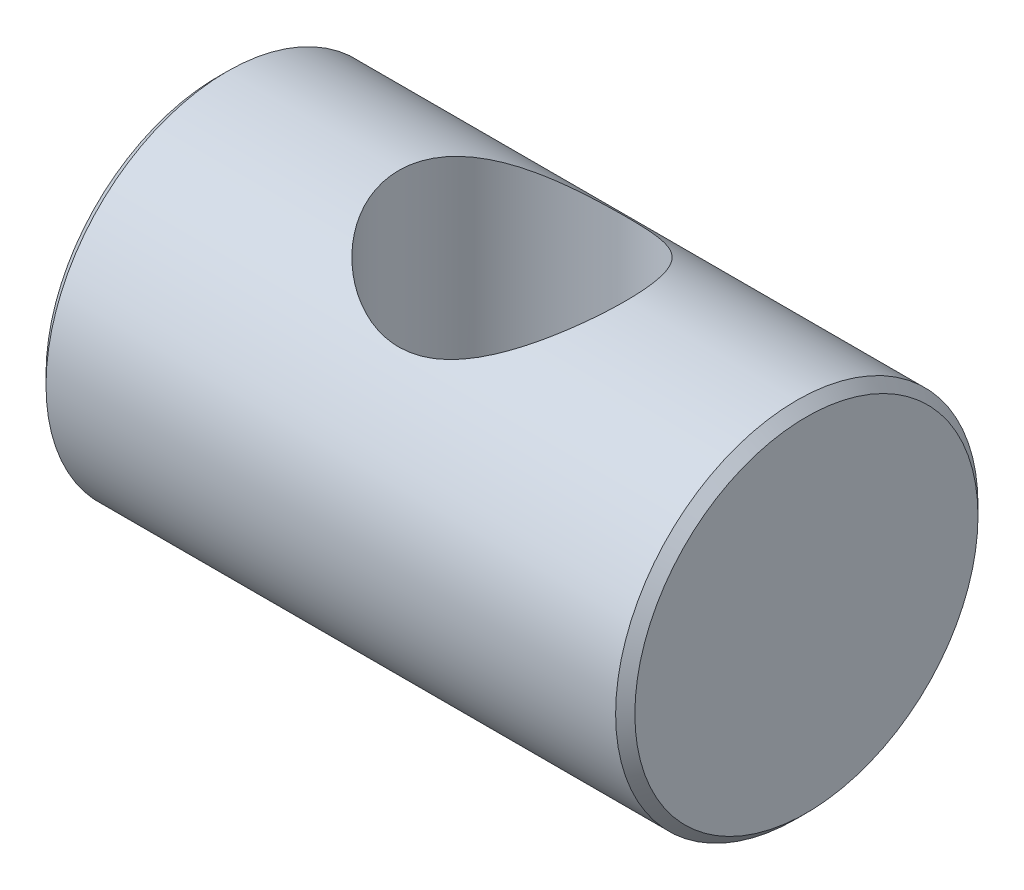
ISO-10303-21;
HEADER;
FILE_DESCRIPTION(('STEP AP214'),'2;1');
FILE_NAME('part.step','',(''),(''),'','','');
FILE_SCHEMA(('AUTOMOTIVE_DESIGN { 1 0 10303 214 1 1 1 1 }'));
ENDSEC;
DATA;
#1=APPLICATION_CONTEXT('core data for automotive mechanical design processes');
#2=APPLICATION_PROTOCOL_DEFINITION('international standard','automotive_design',2000,#1);
#3=PRODUCT_CONTEXT('',#1,'mechanical');
#4=PRODUCT('Part','Part','',(#3));
#5=PRODUCT_RELATED_PRODUCT_CATEGORY('part','',(#4));
#6=PRODUCT_DEFINITION_FORMATION('','',#4);
#7=PRODUCT_DEFINITION_CONTEXT('part definition',#1,'design');
#8=PRODUCT_DEFINITION('design','',#6,#7);
#9=PRODUCT_DEFINITION_SHAPE('','',#8);
#10=(LENGTH_UNIT() NAMED_UNIT(*) SI_UNIT(.MILLI.,.METRE.));
#11=(NAMED_UNIT(*) PLANE_ANGLE_UNIT() SI_UNIT($,.RADIAN.));
#12=(NAMED_UNIT(*) SI_UNIT($,.STERADIAN.) SOLID_ANGLE_UNIT());
#13=UNCERTAINTY_MEASURE_WITH_UNIT(LENGTH_MEASURE(1.E-05),#10,'distance_accuracy_value','');
#14=(GEOMETRIC_REPRESENTATION_CONTEXT(3) GLOBAL_UNCERTAINTY_ASSIGNED_CONTEXT((#13)) GLOBAL_UNIT_ASSIGNED_CONTEXT((#10,
#11,#12)) REPRESENTATION_CONTEXT('',''));
#15=CARTESIAN_POINT('',(0.,0.,0.));
#16=DIRECTION('',(0.,0.,1.));
#17=DIRECTION('',(1.,0.,0.));
#18=AXIS2_PLACEMENT_3D('',#15,#16,#17);
#19=CARTESIAN_POINT('',(6.5,3.78786796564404,0.));
#20=DIRECTION('',(-1.,0.,0.));
#21=DIRECTION('',(0.,0.,1.));
#22=AXIS2_PLACEMENT_3D('',#19,#20,#21);
#23=PLANE('',#22);
#24=CARTESIAN_POINT('',(6.49999999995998,0.,0.));
#25=DIRECTION('',(-1.,0.,0.));
#26=DIRECTION('',(0.,0.,1.));
#27=AXIS2_PLACEMENT_3D('',#24,#25,#26);
#28=CIRCLE('',#27,3.7878679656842);
#29=CARTESIAN_POINT('',(6.49999999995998,0.,3.7878679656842));
#30=VERTEX_POINT('',#29);
#31=EDGE_CURVE('E43',#30,#30,#28,.T.);
#32=ORIENTED_EDGE('',*,*,#31,.F.);
#33=EDGE_LOOP('',(#32));
#34=FACE_BOUND('',#33,.T.);
#35=ADVANCED_FACE('F12',(#34),#23,.F.);
#36=CARTESIAN_POINT('',(-6.5,0.,0.));
#37=DIRECTION('',(1.,0.,0.));
#38=DIRECTION('',(0.,0.,-1.));
#39=AXIS2_PLACEMENT_3D('',#36,#37,#38);
#40=PLANE('',#39);
#41=CARTESIAN_POINT('',(-6.50000000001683,0.,0.));
#42=DIRECTION('',(1.,0.,0.));
#43=DIRECTION('',(0.,0.,-1.));
#44=AXIS2_PLACEMENT_3D('',#41,#42,#43);
#45=CIRCLE('',#44,3.78786796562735);
#46=CARTESIAN_POINT('',(-6.50000000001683,0.,-3.78786796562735));
#47=VERTEX_POINT('',#46);
#48=EDGE_CURVE('E70',#47,#47,#45,.T.);
#49=ORIENTED_EDGE('',*,*,#48,.F.);
#50=EDGE_LOOP('',(#49));
#51=FACE_BOUND('',#50,.T.);
#52=ADVANCED_FACE('F59',(#51),#40,.F.);
#53=CARTESIAN_POINT('',(6.28786796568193,0.,0.));
#54=DIRECTION('',(-1.,0.,0.));
#55=DIRECTION('',(0.,0.,1.));
#56=AXIS2_PLACEMENT_3D('',#53,#54,#55);
#57=CONICAL_SURFACE('',#56,4.0000000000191,0.785398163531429);
#58=CARTESIAN_POINT('',(6.28786796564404,0.,0.));
#59=DIRECTION('',(1.,0.,0.));
#60=DIRECTION('',(0.,0.,-1.));
#61=AXIS2_PLACEMENT_3D('',#58,#59,#60);
#62=CIRCLE('',#61,4.);
#63=CARTESIAN_POINT('',(6.28786796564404,0.,-4.));
#64=VERTEX_POINT('',#63);
#65=EDGE_CURVE('E37',#64,#64,#62,.F.);
#66=ORIENTED_EDGE('',*,*,#65,.F.);
#67=EDGE_LOOP('',(#66));
#68=FACE_BOUND('',#67,.T.);
#69=ORIENTED_EDGE('',*,*,#31,.T.);
#70=EDGE_LOOP('',(#69));
#71=FACE_BOUND('',#70,.T.);
#72=ADVANCED_FACE('F64',(#68,#71),#57,.T.);
#73=CARTESIAN_POINT('',(-6.28786796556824,0.,0.));
#74=DIRECTION('',(1.,0.,0.));
#75=DIRECTION('',(0.,0.,-1.));
#76=AXIS2_PLACEMENT_3D('',#73,#74,#75);
#77=CONICAL_SURFACE('',#76,4.00000000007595,0.785398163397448);
#78=ORIENTED_EDGE('',*,*,#48,.T.);
#79=EDGE_LOOP('',(#78));
#80=FACE_BOUND('',#79,.T.);
#81=CARTESIAN_POINT('',(-6.28786796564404,0.,0.));
#82=DIRECTION('',(1.,0.,0.));
#83=DIRECTION('',(0.,0.,-1.));
#84=AXIS2_PLACEMENT_3D('',#81,#82,#83);
#85=CIRCLE('',#84,4.);
#86=CARTESIAN_POINT('',(-6.28786796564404,0.,-4.));
#87=VERTEX_POINT('',#86);
#88=EDGE_CURVE('E31',#87,#87,#85,.T.);
#89=ORIENTED_EDGE('',*,*,#88,.F.);
#90=EDGE_LOOP('',(#89));
#91=FACE_BOUND('',#90,.T.);
#92=ADVANCED_FACE('F56',(#80,#91),#77,.T.);
#93=CARTESIAN_POINT('',(6.5,0.,0.));
#94=DIRECTION('',(1.,0.,0.));
#95=DIRECTION('',(0.,0.,-1.));
#96=AXIS2_PLACEMENT_3D('',#93,#94,#95);
#97=CYLINDRICAL_SURFACE('',#96,4.);
#98=CARTESIAN_POINT('',(2.5,-4.,0.));
#99=CARTESIAN_POINT('',(2.49998952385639,-3.99999041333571,0.127017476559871));
#100=CARTESIAN_POINT('',(2.49025350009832,-3.9938860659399,0.254191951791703));
#101=CARTESIAN_POINT('',(2.45182887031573,-3.97004375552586,0.504637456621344));
#102=CARTESIAN_POINT('',(2.4231041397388,-3.95228361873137,0.627900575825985));
#103=CARTESIAN_POINT('',(2.34837714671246,-3.90691695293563,0.866410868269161));
#104=CARTESIAN_POINT('',(2.30246039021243,-3.87935918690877,0.981694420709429));
#105=CARTESIAN_POINT('',(2.19522833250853,-3.81669199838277,1.20252080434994));
#106=CARTESIAN_POINT('',(2.13391473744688,-3.7815834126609,1.30806471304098));
#107=CARTESIAN_POINT('',(1.9922268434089,-3.70340304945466,1.51594836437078));
#108=CARTESIAN_POINT('',(1.91072139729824,-3.65991924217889,1.61735911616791));
#109=CARTESIAN_POINT('',(1.73356165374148,-3.57062700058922,1.80597275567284));
#110=CARTESIAN_POINT('',(1.63788834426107,-3.52481549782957,1.89315621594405));
#111=CARTESIAN_POINT('',(1.4199322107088,-3.42860837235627,2.06285746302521));
#112=CARTESIAN_POINT('',(1.29580042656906,-3.37843221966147,2.14314412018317));
#113=CARTESIAN_POINT('',(1.03287036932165,-3.28660396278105,2.28147932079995));
#114=CARTESIAN_POINT('',(0.894097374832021,-3.24493752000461,2.33956541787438));
#115=CARTESIAN_POINT('',(0.642378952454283,-3.18619151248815,2.41866801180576));
#116=CARTESIAN_POINT('',(0.532066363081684,-3.16553811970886,2.44539104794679));
#117=CARTESIAN_POINT('',(0.307388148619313,-3.1356271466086,2.4836368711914));
#118=CARTESIAN_POINT('',(0.193028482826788,-3.12635347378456,2.49518112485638));
#119=CARTESIAN_POINT('',(-0.0368260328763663,-3.12059771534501,2.50237836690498));
#120=CARTESIAN_POINT('',(-0.152323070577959,-3.12414917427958,2.49798968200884));
#121=CARTESIAN_POINT('',(-0.380620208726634,-3.14354804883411,2.47352633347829));
#122=CARTESIAN_POINT('',(-0.493418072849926,-3.15940531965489,2.45343909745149));
#123=CARTESIAN_POINT('',(-0.710876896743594,-3.20065145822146,2.3993620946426));
#124=CARTESIAN_POINT('',(-0.815664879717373,-3.22581428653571,2.36570043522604));
#125=CARTESIAN_POINT('',(-1.01832239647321,-3.28291134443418,2.28580369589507));
#126=CARTESIAN_POINT('',(-1.11618946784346,-3.31484796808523,2.2395641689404));
#127=CARTESIAN_POINT('',(-1.32166640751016,-3.38909625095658,2.12589830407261));
#128=CARTESIAN_POINT('',(-1.42768105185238,-3.4322315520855,2.05612773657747));
#129=CARTESIAN_POINT('',(-1.6276611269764,-3.52011451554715,1.90176111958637));
#130=CARTESIAN_POINT('',(-1.72161400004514,-3.56486379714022,1.81714983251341));
#131=CARTESIAN_POINT('',(-1.91060100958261,-3.65959667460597,1.61904732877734));
#132=CARTESIAN_POINT('',(-2.0032559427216,-3.70922571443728,1.50309447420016));
#133=CARTESIAN_POINT('',(-2.16771179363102,-3.8005660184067,1.25426444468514));
#134=CARTESIAN_POINT('',(-2.23952090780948,-3.84228039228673,1.12139395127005));
#135=CARTESIAN_POINT('',(-2.32734595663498,-3.89435975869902,0.915775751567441));
#136=CARTESIAN_POINT('',(-2.35283428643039,-3.90966874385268,0.848193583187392));
#137=CARTESIAN_POINT('',(-2.39800765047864,-3.93701839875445,0.710492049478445));
#138=CARTESIAN_POINT('',(-2.41769603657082,-3.94906095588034,0.640374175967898));
#139=CARTESIAN_POINT('',(-2.45093416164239,-3.96949699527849,0.498239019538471));
#140=CARTESIAN_POINT('',(-2.464489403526,-3.97789374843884,0.426223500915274));
#141=CARTESIAN_POINT('',(-2.48524629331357,-3.99078766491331,0.280965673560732));
#142=CARTESIAN_POINT('',(-2.49244902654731,-3.99528549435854,0.207723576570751));
#143=CARTESIAN_POINT('',(-2.50310930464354,-4.00193773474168,0.00911917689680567));
#144=CARTESIAN_POINT('',(-2.50040036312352,-4.000238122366,-0.116782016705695));
#145=CARTESIAN_POINT('',(-2.47624033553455,-3.98518313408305,-0.365967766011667));
#146=CARTESIAN_POINT('',(-2.45479052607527,-3.97182855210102,-0.489252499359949));
#147=CARTESIAN_POINT('',(-2.39552141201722,-3.93547975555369,-0.725036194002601));
#148=CARTESIAN_POINT('',(-2.35837527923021,-3.91288306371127,-0.837768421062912));
#149=CARTESIAN_POINT('',(-2.26940762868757,-3.85991402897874,-1.05527816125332));
#150=CARTESIAN_POINT('',(-2.21758365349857,-3.82954038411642,-1.16005433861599));
#151=CARTESIAN_POINT('',(-2.09496946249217,-3.75980014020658,-1.37016761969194));
#152=CARTESIAN_POINT('',(-2.02279282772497,-3.71983526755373,-1.47449380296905));
#153=CARTESIAN_POINT('',(-1.86441230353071,-3.63613942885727,-1.67028541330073));
#154=CARTESIAN_POINT('',(-1.77819283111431,-3.59240430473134,-1.76173634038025));
#155=CARTESIAN_POINT('',(-1.57972991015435,-3.49811738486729,-1.94294835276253));
#156=CARTESIAN_POINT('',(-1.46552558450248,-3.44749766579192,-2.03053702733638));
#157=CARTESIAN_POINT('',(-1.22224843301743,-3.35133525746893,-2.18560704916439));
#158=CARTESIAN_POINT('',(-1.09318598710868,-3.30578906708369,-2.25310231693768));
#159=CARTESIAN_POINT('',(-0.850615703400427,-3.23467060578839,-2.35369543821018));
#160=CARTESIAN_POINT('',(-0.739518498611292,-3.20691272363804,-2.39103791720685));
#161=CARTESIAN_POINT('',(-0.511213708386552,-3.16210061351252,-2.45000216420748));
#162=CARTESIAN_POINT('',(-0.394015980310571,-3.1450296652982,-2.47164849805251));
#163=CARTESIAN_POINT('',(-0.155819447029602,-3.124126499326,-2.49802767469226));
#164=CARTESIAN_POINT('',(-0.0348028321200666,-3.12037003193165,-2.50266374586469));
#165=CARTESIAN_POINT('',(0.206261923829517,-3.12698126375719,-2.49439556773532));
#166=CARTESIAN_POINT('',(0.326309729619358,-3.13735365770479,-2.48148548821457));
#167=CARTESIAN_POINT('',(0.552059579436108,-3.16910777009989,-2.44076547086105));
#168=CARTESIAN_POINT('',(0.658138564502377,-3.18953614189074,-2.41423847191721));
#169=CARTESIAN_POINT('',(0.864270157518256,-3.23835062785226,-2.34835238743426));
#170=CARTESIAN_POINT('',(0.964320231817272,-3.26674005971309,-2.30898795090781));
#171=CARTESIAN_POINT('',(1.17119332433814,-3.33327797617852,-2.21205415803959));
#172=CARTESIAN_POINT('',(1.27689994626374,-3.3722442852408,-2.15267427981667));
#173=CARTESIAN_POINT('',(1.47787738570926,-3.45335445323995,-2.01999894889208));
#174=CARTESIAN_POINT('',(1.57313966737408,-3.49550086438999,-1.94669224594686));
#175=CARTESIAN_POINT('',(1.77002558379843,-3.58803675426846,-1.77134669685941));
#176=CARTESIAN_POINT('',(1.86916976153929,-3.63840488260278,-1.66649284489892));
#177=CARTESIAN_POINT('',(2.04900159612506,-3.7339805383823,-1.43961937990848));
#178=CARTESIAN_POINT('',(2.12967782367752,-3.77918486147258,-1.3175892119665));
#179=CARTESIAN_POINT('',(2.23456343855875,-3.83959214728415,-1.12346357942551));
#180=CARTESIAN_POINT('',(2.26687480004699,-3.85851834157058,-1.05679601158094));
#181=CARTESIAN_POINT('',(2.32567225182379,-3.89335165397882,-0.920199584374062));
#182=CARTESIAN_POINT('',(2.3521617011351,-3.9092605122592,-0.850272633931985));
#183=CARTESIAN_POINT('',(2.39885714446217,-3.93753374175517,-0.707873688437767));
#184=CARTESIAN_POINT('',(2.41908005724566,-3.94990764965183,-0.635409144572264));
#185=CARTESIAN_POINT('',(2.45297545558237,-3.97075677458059,-0.488456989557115));
#186=CARTESIAN_POINT('',(2.46665277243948,-3.97923486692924,-0.413970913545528));
#187=CARTESIAN_POINT('',(2.48459041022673,-3.99038271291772,-0.28285260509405));
#188=CARTESIAN_POINT('',(2.49036153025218,-3.99398159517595,-0.226501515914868));
#189=CARTESIAN_POINT('',(2.49806878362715,-3.99879245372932,-0.113444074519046));
#190=CARTESIAN_POINT('',(2.50000467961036,-4.00000428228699,-0.0567377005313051));
#191=CARTESIAN_POINT('',(2.5,-4.,0.));
#192=B_SPLINE_CURVE_WITH_KNOTS('',3,(#98,#99,#100,#101,#102,#103,#104,#105,#106,#107,#108,#109,
#110,#111,#112,#113,#114,#115,#116,#117,#118,#119,#120,#121,#122,#123,#124,#125,#126,#127,#128,
#129,#130,#131,#132,#133,#134,#135,#136,#137,#138,#139,#140,#141,#142,#143,#144,#145,#146,#147,
#148,#149,#150,#151,#152,#153,#154,#155,#156,#157,#158,#159,#160,#161,#162,#163,#164,#165,#166,
#167,#168,#169,#170,#171,#172,#173,#174,#175,#176,#177,#178,#179,#180,#181,#182,#183,#184,#185,
#186,#187,#188,#189,#190,#191),.UNSPECIFIED.,.T.,.F.,(4,2,2,2,2,2,2,2,2,2,2,2,2,2,2,2,2,2,2,2,2,
2,2,2,2,2,2,2,2,2,2,2,2,2,2,2,2,2,2,2,2,2,2,2,2,2,4),(0.,0.380824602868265,0.762375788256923,
1.14205397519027,1.52169010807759,1.93164374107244,2.34215256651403,2.80825951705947,
3.27357449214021,3.61824017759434,3.96241789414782,4.30749646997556,4.65285169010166,
4.99031678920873,5.32790135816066,5.7285490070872,6.12961045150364,6.59684361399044,
7.06389281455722,7.28510978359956,7.50619865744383,7.72708876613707,7.94794112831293,
8.32363778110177,8.69930884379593,9.06028425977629,9.42132014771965,9.81879878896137,
10.216721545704,10.6724083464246,11.1277787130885,11.4876929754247,11.8470427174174,
12.2084336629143,12.5699447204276,12.9023575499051,13.2349091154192,13.6156046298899,
13.9966089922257,14.4531049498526,14.9098826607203,15.1389848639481,15.3679545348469,
15.5963005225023,15.8244777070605,15.994578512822,16.1646898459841),.UNSPECIFIED.);
#193=CARTESIAN_POINT('',(2.5,-4.,0.));
#194=VERTEX_POINT('',#193);
#195=EDGE_CURVE('E8',#194,#194,#192,.T.);
#196=ORIENTED_EDGE('',*,*,#195,.F.);
#197=EDGE_LOOP('',(#196));
#198=FACE_BOUND('',#197,.T.);
#199=CARTESIAN_POINT('',(0.,3.1224989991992,2.5));
#200=CARTESIAN_POINT('',(0.0621567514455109,3.12249991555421,2.49999941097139));
#201=CARTESIAN_POINT('',(0.124325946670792,3.12436490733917,2.49767581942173));
#202=CARTESIAN_POINT('',(0.248117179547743,3.13172923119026,2.48843349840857));
#203=CARTESIAN_POINT('',(0.309738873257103,3.13723070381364,2.48151206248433));
#204=CARTESIAN_POINT('',(0.493226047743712,3.15888953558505,2.45397595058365));
#205=CARTESIAN_POINT('',(0.613548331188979,3.18020036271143,2.42658990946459));
#206=CARTESIAN_POINT('',(0.845598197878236,3.23299770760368,2.35576217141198));
#207=CARTESIAN_POINT('',(0.957390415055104,3.26439575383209,2.31245961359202));
#208=CARTESIAN_POINT('',(1.17200852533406,3.33366000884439,2.21143916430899));
#209=CARTESIAN_POINT('',(1.27483417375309,3.37152639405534,2.15372087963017));
#210=CARTESIAN_POINT('',(1.48373398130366,3.45559225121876,2.01647682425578));
#211=CARTESIAN_POINT('',(1.58839332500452,3.50222814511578,1.93506425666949));
#212=CARTESIAN_POINT('',(1.78376155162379,3.59505503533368,1.75662526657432));
#213=CARTESIAN_POINT('',(1.87445827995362,3.64124561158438,1.65958538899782));
#214=CARTESIAN_POINT('',(2.05022029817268,3.73459524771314,1.43833990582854));
#215=CARTESIAN_POINT('',(2.13328618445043,3.78119887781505,1.31226934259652));
#216=CARTESIAN_POINT('',(2.24054515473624,3.84307251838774,1.11163395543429));
#217=CARTESIAN_POINT('',(2.27341513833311,3.86236283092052,1.04281240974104));
#218=CARTESIAN_POINT('',(2.33295468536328,3.89770436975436,0.90175876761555));
#219=CARTESIAN_POINT('',(2.35962853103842,3.91375783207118,0.829529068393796));
#220=CARTESIAN_POINT('',(2.40398381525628,3.94066759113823,0.689700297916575));
#221=CARTESIAN_POINT('',(2.42230197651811,3.95188535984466,0.622371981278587));
#222=CARTESIAN_POINT('',(2.45330228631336,3.97096241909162,0.485997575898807));
#223=CARTESIAN_POINT('',(2.46598768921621,3.97882364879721,0.416952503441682));
#224=CARTESIAN_POINT('',(2.48551379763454,3.99095470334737,0.277765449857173));
#225=CARTESIAN_POINT('',(2.49235811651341,3.99522674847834,0.207624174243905));
#226=CARTESIAN_POINT('',(2.50009921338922,4.00006125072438,0.0669114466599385));
#227=CARTESIAN_POINT('',(2.50099667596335,4.00062413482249,-0.00365995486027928));
#228=CARTESIAN_POINT('',(2.49527462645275,3.99704479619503,-0.196045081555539));
#229=CARTESIAN_POINT('',(2.48269349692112,3.98917040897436,-0.317681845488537));
#230=CARTESIAN_POINT('',(2.44026978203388,3.96290903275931,-0.556636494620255));
#231=CARTESIAN_POINT('',(2.41042589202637,3.94452124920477,-0.673954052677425));
#232=CARTESIAN_POINT('',(2.33479144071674,3.89876170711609,-0.901771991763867));
#233=CARTESIAN_POINT('',(2.28896008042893,3.87136697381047,-1.01225407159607));
#234=CARTESIAN_POINT('',(2.18306276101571,3.80971291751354,-1.22404012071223));
#235=CARTESIAN_POINT('',(2.12299355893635,3.77545203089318,-1.32534199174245));
#236=CARTESIAN_POINT('',(1.98194358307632,3.69786441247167,-1.52942649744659));
#237=CARTESIAN_POINT('',(1.89929072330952,3.65394006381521,-1.63082454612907));
#238=CARTESIAN_POINT('',(1.71973526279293,3.56390927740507,-1.81919733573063));
#239=CARTESIAN_POINT('',(1.62281195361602,3.51779973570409,-1.90615071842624));
#240=CARTESIAN_POINT('',(1.40258874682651,3.42142883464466,-2.07470887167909));
#241=CARTESIAN_POINT('',(1.27749723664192,3.37141162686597,-2.15413229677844));
#242=CARTESIAN_POINT('',(1.01270776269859,3.28028278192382,-2.29052307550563));
#243=CARTESIAN_POINT('',(0.873037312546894,3.23915480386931,-2.34753179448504));
#244=CARTESIAN_POINT('',(0.620461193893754,3.18183753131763,-2.42437133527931));
#245=CARTESIAN_POINT('',(0.510178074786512,3.16193408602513,-2.45003683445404));
#246=CARTESIAN_POINT('',(0.285769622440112,3.13358277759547,-2.48620337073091));
#247=CARTESIAN_POINT('',(0.171649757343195,3.12511926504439,-2.49672512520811));
#248=CARTESIAN_POINT('',(-0.0574573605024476,3.12092267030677,-2.5019707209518));
#249=CARTESIAN_POINT('',(-0.172446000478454,3.12521876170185,-2.49665835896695));
#250=CARTESIAN_POINT('',(-0.399561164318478,3.14592085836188,-2.47051466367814));
#251=CARTESIAN_POINT('',(-0.511685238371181,3.16233689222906,-2.44967047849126));
#252=CARTESIAN_POINT('',(-0.728436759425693,3.20460120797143,-2.39409874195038));
#253=CARTESIAN_POINT('',(-0.833157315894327,3.23028954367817,-2.35960571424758));
#254=CARTESIAN_POINT('',(-1.03557469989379,3.28831148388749,-2.27804893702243));
#255=CARTESIAN_POINT('',(-1.13326901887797,3.32064744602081,-2.23098072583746));
#256=CARTESIAN_POINT('',(-1.33861194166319,3.39574401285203,-2.11530798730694));
#257=CARTESIAN_POINT('',(-1.44461452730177,3.43931724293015,-2.04430931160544));
#258=CARTESIAN_POINT('',(-1.64437066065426,3.52787943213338,-1.88737868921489));
#259=CARTESIAN_POINT('',(-1.73811132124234,3.57286982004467,-1.80143124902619));
#260=CARTESIAN_POINT('',(-1.92596407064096,3.66766209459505,-1.60076932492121));
#261=CARTESIAN_POINT('',(-2.0177273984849,3.71707933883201,-1.48365201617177));
#262=CARTESIAN_POINT('',(-2.18014701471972,3.80768973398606,-1.23256787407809));
#263=CARTESIAN_POINT('',(-2.25081319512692,3.84888673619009,-1.09860897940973));
#264=CARTESIAN_POINT('',(-2.33658106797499,3.89988966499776,-0.891930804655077));
#265=CARTESIAN_POINT('',(-2.36129744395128,3.91477055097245,-0.824318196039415));
#266=CARTESIAN_POINT('',(-2.40493827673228,3.94124643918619,-0.686640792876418));
#267=CARTESIAN_POINT('',(-2.42386608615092,3.95284334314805,-0.61657744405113));
#268=CARTESIAN_POINT('',(-2.45560583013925,3.9723851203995,-0.474639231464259));
#269=CARTESIAN_POINT('',(-2.46842309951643,3.98033317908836,-0.402766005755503));
#270=CARTESIAN_POINT('',(-2.4877391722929,3.99234168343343,-0.257881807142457));
#271=CARTESIAN_POINT('',(-2.49423902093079,3.99640277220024,-0.184871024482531));
#272=CARTESIAN_POINT('',(-2.50307151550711,4.00191521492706,0.013110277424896));
#273=CARTESIAN_POINT('',(-2.49926579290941,3.99952706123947,0.138539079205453));
#274=CARTESIAN_POINT('',(-2.47308241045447,3.98321975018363,0.386583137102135));
#275=CARTESIAN_POINT('',(-2.45070559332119,3.96930111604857,0.509198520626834));
#276=CARTESIAN_POINT('',(-2.38967758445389,3.93192083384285,0.744080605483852));
#277=CARTESIAN_POINT('',(-2.35161792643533,3.90880701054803,0.856558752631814));
#278=CARTESIAN_POINT('',(-2.26088053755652,3.85489971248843,1.07343034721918));
#279=CARTESIAN_POINT('',(-2.2082003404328,3.82410494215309,1.17782242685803));
#280=CARTESIAN_POINT('',(-2.08367872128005,3.75350673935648,1.38731297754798));
#281=CARTESIAN_POINT('',(-2.0104160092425,3.71310001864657,1.4913601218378));
#282=CARTESIAN_POINT('',(-1.84984676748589,3.62867283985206,1.68643334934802));
#283=CARTESIAN_POINT('',(-1.76252439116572,3.58464833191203,1.77744451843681));
#284=CARTESIAN_POINT('',(-1.56176748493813,3.49000828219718,1.95744716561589));
#285=CARTESIAN_POINT('',(-1.44638338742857,3.43935738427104,2.04425661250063));
#286=CARTESIAN_POINT('',(-1.20071059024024,3.34349647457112,2.19754648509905));
#287=CARTESIAN_POINT('',(-1.07043018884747,3.2982834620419,2.26403815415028));
#288=CARTESIAN_POINT('',(-0.827194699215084,3.22859539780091,2.36198229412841));
#289=CARTESIAN_POINT('',(-0.716729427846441,3.20174639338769,2.39792458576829));
#290=CARTESIAN_POINT('',(-0.490060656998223,3.1587835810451,2.45425618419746));
#291=CARTESIAN_POINT('',(-0.37387658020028,3.14263581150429,2.47469472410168));
#292=CARTESIAN_POINT('',(-0.213940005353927,3.12952857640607,2.49119847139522));
#293=CARTESIAN_POINT('',(-0.171274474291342,3.1268999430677,2.49449433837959));
#294=CARTESIAN_POINT('',(-0.0857413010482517,3.12338461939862,2.49889558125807));
#295=CARTESIAN_POINT('',(-0.0428736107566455,3.12249836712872,2.50000040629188));
#296=CARTESIAN_POINT('',(0.,3.1224989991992,2.5));
#297=B_SPLINE_CURVE_WITH_KNOTS('',3,(#199,#200,#201,#202,#203,#204,#205,#206,#207,#208,#209,
#210,#211,#212,#213,#214,#215,#216,#217,#218,#219,#220,#221,#222,#223,#224,#225,#226,#227,#228,
#229,#230,#231,#232,#233,#234,#235,#236,#237,#238,#239,#240,#241,#242,#243,#244,#245,#246,#247,
#248,#249,#250,#251,#252,#253,#254,#255,#256,#257,#258,#259,#260,#261,#262,#263,#264,#265,#266,
#267,#268,#269,#270,#271,#272,#273,#274,#275,#276,#277,#278,#279,#280,#281,#282,#283,#284,#285,
#286,#287,#288,#289,#290,#291,#292,#293,#294,#295,#296),.UNSPECIFIED.,.T.,.F.,(4,2,2,2,2,2,2,2,
2,2,2,2,2,2,2,2,2,2,2,2,2,2,2,2,2,2,2,2,2,2,2,2,2,2,2,2,2,2,2,2,2,2,2,2,2,2,2,2,4),(0.,
0.186415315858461,0.372940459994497,0.746478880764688,1.11682668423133,1.48718459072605,
1.9072279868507,2.32763499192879,2.7987602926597,3.03445880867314,3.26999394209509,
3.48170145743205,3.69328649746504,3.90474055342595,4.11617026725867,4.48184709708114,
4.84755156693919,5.21419620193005,5.58092442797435,5.99329080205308,6.40626158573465,
6.87316206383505,7.33919680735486,7.68265621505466,8.02564530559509,8.36941921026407,
8.7134778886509,9.05186495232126,9.390372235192,9.79332737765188,10.1967026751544,
10.6647326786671,11.1325428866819,11.3527929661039,11.5729152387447,11.7928449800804,
12.0127383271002,12.3871595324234,12.7615637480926,13.1229788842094,13.4844550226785,
13.8834503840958,14.2828986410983,14.7399238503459,15.1966956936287,15.5530255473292,
15.9082190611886,16.0367696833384,16.1653526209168),.UNSPECIFIED.);
#298=CARTESIAN_POINT('',(0.,3.1224989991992,2.5));
#299=VERTEX_POINT('',#298);
#300=EDGE_CURVE('E24',#299,#299,#297,.T.);
#301=ORIENTED_EDGE('',*,*,#300,.F.);
#302=EDGE_LOOP('',(#301));
#303=FACE_BOUND('',#302,.T.);
#304=ORIENTED_EDGE('',*,*,#88,.T.);
#305=EDGE_LOOP('',(#304));
#306=FACE_BOUND('',#305,.T.);
#307=ORIENTED_EDGE('',*,*,#65,.T.);
#308=EDGE_LOOP('',(#307));
#309=FACE_BOUND('',#308,.T.);
#310=ADVANCED_FACE('F45',(#198,#303,#306,#309),#97,.T.);
#311=CARTESIAN_POINT('',(0.,-4.,0.));
#312=DIRECTION('',(0.,1.,0.));
#313=DIRECTION('',(0.,0.,1.));
#314=AXIS2_PLACEMENT_3D('',#311,#312,#313);
#315=CYLINDRICAL_SURFACE('',#314,2.5);
#316=ORIENTED_EDGE('',*,*,#195,.T.);
#317=EDGE_LOOP('',(#316));
#318=FACE_BOUND('',#317,.T.);
#319=ORIENTED_EDGE('',*,*,#300,.T.);
#320=EDGE_LOOP('',(#319));
#321=FACE_BOUND('',#320,.T.);
#322=ADVANCED_FACE('F48',(#318,#321),#315,.F.);
#323=CLOSED_SHELL('',(#35,#52,#72,#92,#310,#322));
#324=MANIFOLD_SOLID_BREP('B1',#323);
#325=ADVANCED_BREP_SHAPE_REPRESENTATION('',(#18,#324),#14);
#326=SHAPE_DEFINITION_REPRESENTATION(#9,#325);
ENDSEC;
END-ISO-10303-21;
